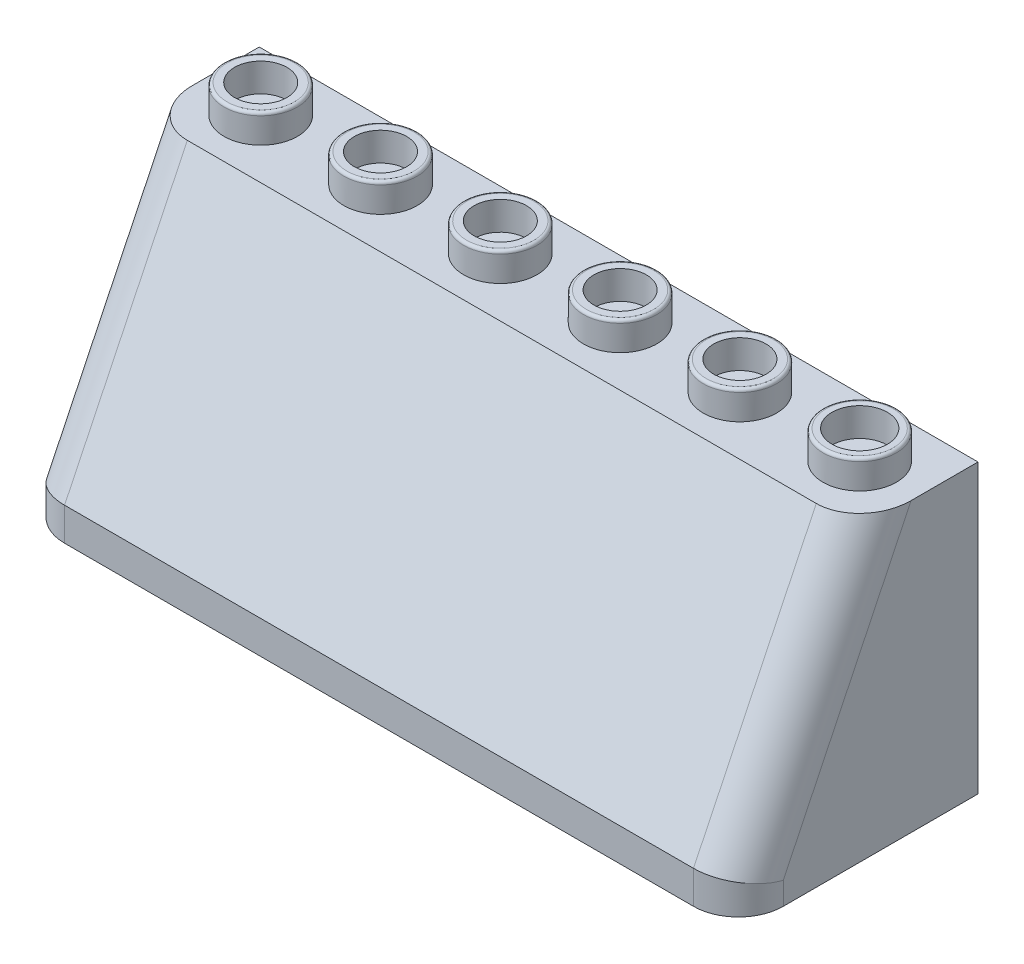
from build123d import *

# Parameters (mm, degrees)
SKIZZE1_W                       = 48
SKIZZE1_H                       = 19.2
LINEAR_AUSTRAGEN1_DEPTH         = 16
SCHNITT_LINEAR_AUSTRAGEN1_DEPTH = 55.116910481
VERRUNDUNG1_R                   = 3
SKIZZE4_R                       = 2.45
SKIZZE4_R_2                     = 1.85
SKIZZE4_R_3                     = 1.75
LINEAR_AUSTRAGEN2_DEPTH         = 1.9
VERRUNDUNG2_R                   = 0.2
SCHNITT_LINEAR_START            = -1.6
SCHNITT_LINEAR_AUSTRAGEN2_DEPTH = 44.8
SKIZZE6_W                       = 32
SKIZZE6_H                       = 8
SCHNITT_LINEAR_AUSTRAGEN3_DEPTH = 3.2
SCHNITT_LINEAR_AUSTRAGEN4_DEPTH = 2.1
VERRUNDUNG3_R                   = 2.2
SKIZZE11_R                      = 1.6
LINEAR_AUSTRAGEN3_DEPTH         = 1.9


with BuildPart() as part:
    # Skizze1 → Linear austragen1 (new body)
    with BuildSketch(Plane.XY):
        with Locations((24, 9.6)):
            Rectangle(SKIZZE1_W, SKIZZE1_H)
    extrude(amount=LINEAR_AUSTRAGEN1_DEPTH)

    # Skizze2 → Schnitt-Linear austragen1 (cut, through all)
    with BuildSketch(Plane(origin=(48, 0, 0), x_dir=(0, 0, -1), z_dir=(1, 0, 0))):
        Polygon((-7.8, 19.2), (-16, 2.2), (-16, 19.2), align=None)
    extrude(amount=-SCHNITT_LINEAR_AUSTRAGEN1_DEPTH, mode=Mode.SUBTRACT)

    # Verrundung1
    verrundung1_edges = [part.edges().sort_by_distance(p)[0] for p in [
        (48, 1.1, 16),
        (0, 1.1, 16),
        (0, 10.7, 11.9),
        (48, 10.7, 11.9),
    ]]
    fillet(verrundung1_edges, radius=VERRUNDUNG1_R)

    # Skizze4 → Linear austragen2 (add)
    # profile 1 of 6: a face of its own
    with BuildSketch(Plane(origin=(0, 19.2, 0), x_dir=(-1, 0, 0), z_dir=(0, 1, 0))):
        with Locations(Location((-44, 3.9, 0), (0, 0, 270))):
            Circle(SKIZZE4_R)
        with Locations(Location((-44, 3.9, 0), (0, 0, 270))):
            Circle(SKIZZE4_R_2, mode=Mode.SUBTRACT)
    # profile 2 of 6: a face of its own
    with BuildSketch(Plane(origin=(0, 19.2, 0), x_dir=(-1, 0, 0), z_dir=(0, 1, 0))):
        with Locations(Location((-36, 3.9, 0), (0, 0, 270))):
            Circle(SKIZZE4_R)
        with Locations(Location((-36, 3.9, 0), (0, 0, 270))):
            Circle(SKIZZE4_R_3, mode=Mode.SUBTRACT)
    # profile 3 of 6: a face of its own
    with BuildSketch(Plane(origin=(0, 19.2, 0), x_dir=(-1, 0, 0), z_dir=(0, 1, 0))):
        with Locations(Location((-28, 3.9, 0), (0, 0, 270))):
            Circle(SKIZZE4_R)
        with Locations(Location((-28, 3.9, 0), (0, 0, 270))):
            Circle(SKIZZE4_R_3, mode=Mode.SUBTRACT)
    # profile 4 of 6: a face of its own
    with BuildSketch(Plane(origin=(0, 19.2, 0), x_dir=(-1, 0, 0), z_dir=(0, 1, 0))):
        with Locations(Location((-20, 3.9, 0), (0, 0, 270))):
            Circle(SKIZZE4_R)
        with Locations(Location((-20, 3.9, 0), (0, 0, 270))):
            Circle(SKIZZE4_R_3, mode=Mode.SUBTRACT)
    # profile 5 of 6: a face of its own
    with BuildSketch(Plane(origin=(0, 19.2, 0), x_dir=(-1, 0, 0), z_dir=(0, 1, 0))):
        with Locations(Location((-12, 3.9, 0), (0, 0, 270))):
            Circle(SKIZZE4_R)
        with Locations(Location((-12, 3.9, 0), (0, 0, 270))):
            Circle(SKIZZE4_R_3, mode=Mode.SUBTRACT)
    # profile 6 of 6: a face of its own
    with BuildSketch(Plane(origin=(0, 19.2, 0), x_dir=(-1, 0, 0), z_dir=(0, 1, 0))):
        with Locations(Location((-4, 3.9, 0), (0, 0, 270))):
            Circle(SKIZZE4_R)
        with Locations(Location((-4, 3.9, 0), (0, 0, 270))):
            Circle(SKIZZE4_R_3, mode=Mode.SUBTRACT)
    extrude(amount=LINEAR_AUSTRAGEN2_DEPTH)

    # Verrundung2
    verrundung2_edges = [part.edges().sort_by_distance(p)[0] for p in [
        (44, 21.1, 6.35),
        (36, 21.1, 6.35),
        (28, 21.1, 6.35),
        (20, 21.1, 6.35),
        (12, 21.1, 6.35),
        (4, 21.1, 6.35),
    ]]
    fillet(verrundung2_edges, radius=VERRUNDUNG2_R)

    # Skizze5 → Schnitt-Linear austragen2 (cut)
    with BuildSketch(Plane.ZY.offset(SCHNITT_LINEAR_START)):
        Polygon((0, 3.2), (13.845882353, 3.2), (6.9, 17.6), (0, 17.6), align=None)
    extrude(amount=-SCHNITT_LINEAR_AUSTRAGEN2_DEPTH, mode=Mode.SUBTRACT)

    # Skizze6 → Schnitt-Linear austragen3 (cut)
    with BuildSketch(Plane.XZ):
        with Locations((24, 4)):
            Rectangle(SKIZZE6_W, SKIZZE6_H)
    extrude(amount=-SCHNITT_LINEAR_AUSTRAGEN3_DEPTH, mode=Mode.SUBTRACT)

    # Skizze9 → Schnitt-Linear austragen4 (cut)
    with BuildSketch(Plane.XZ):
        Polygon((1.6, 1.6), (6.4, 1.6), (6.4, 9.6), (41.6, 9.6), (41.6, 1.6), (46.4, 1.6), (46.4, 14.4), (1.6, 14.4), align=None)
    extrude(amount=-SCHNITT_LINEAR_AUSTRAGEN4_DEPTH, mode=Mode.SUBTRACT)

    # Verrundung3
    verrundung3_edges = [part.edges().sort_by_distance(p)[0] for p in [
        (1.6, 1.05, 14.4),
        (46.4, 1.05, 14.4),
    ]]
    fillet(verrundung3_edges, radius=VERRUNDUNG3_R)

    # Skizze11 → Linear austragen3 (add)
    with BuildSketch(Plane.XZ.offset(-2.1)):
        with Locations(Location((24, 12, 0), (0, 0, 90))):
            Circle(SKIZZE11_R)
        with Locations(Location((16, 12, 0), (0, 0, 90))):
            Circle(SKIZZE11_R)
        with Locations(Location((8, 12, 0), (0, 0, 90))):
            Circle(SKIZZE11_R)
        with Locations(Location((32, 12, 0), (0, 0, 90))):
            Circle(SKIZZE11_R)
        with Locations(Location((40, 12, 0), (0, 0, 90))):
            Circle(SKIZZE11_R)
        with Locations(Location((4, 8, 0), (0, 0, 90))):
            Circle(SKIZZE11_R)
        with Locations(Location((44, 8, 0), (0, 0, 90))):
            Circle(SKIZZE11_R)
    extrude(amount=LINEAR_AUSTRAGEN3_DEPTH)


solid = part.part
